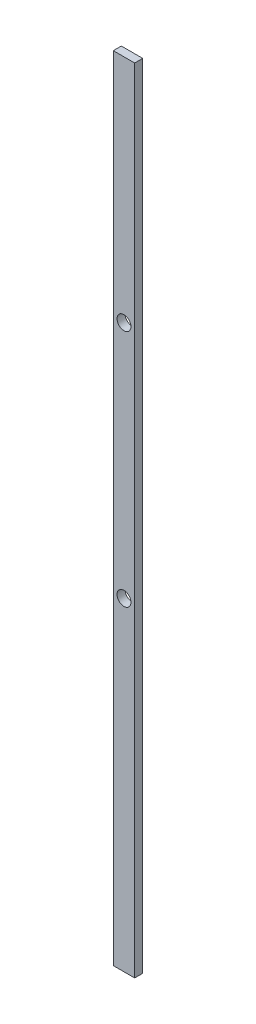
ISO-10303-21;
HEADER;
FILE_DESCRIPTION(('STEP AP214'),'2;1');
FILE_NAME('part.step','',(''),(''),'','','');
FILE_SCHEMA(('AUTOMOTIVE_DESIGN { 1 0 10303 214 1 1 1 1 }'));
ENDSEC;
DATA;
#1=APPLICATION_CONTEXT('core data for automotive mechanical design processes');
#2=APPLICATION_PROTOCOL_DEFINITION('international standard','automotive_design',2000,#1);
#3=PRODUCT_CONTEXT('',#1,'mechanical');
#4=PRODUCT('Part','Part','',(#3));
#5=PRODUCT_RELATED_PRODUCT_CATEGORY('part','',(#4));
#6=PRODUCT_DEFINITION_FORMATION('','',#4);
#7=PRODUCT_DEFINITION_CONTEXT('part definition',#1,'design');
#8=PRODUCT_DEFINITION('design','',#6,#7);
#9=PRODUCT_DEFINITION_SHAPE('','',#8);
#10=(LENGTH_UNIT() NAMED_UNIT(*) SI_UNIT(.MILLI.,.METRE.));
#11=(NAMED_UNIT(*) PLANE_ANGLE_UNIT() SI_UNIT($,.RADIAN.));
#12=(NAMED_UNIT(*) SI_UNIT($,.STERADIAN.) SOLID_ANGLE_UNIT());
#13=UNCERTAINTY_MEASURE_WITH_UNIT(LENGTH_MEASURE(1.E-05),#10,'distance_accuracy_value','');
#14=(GEOMETRIC_REPRESENTATION_CONTEXT(3) GLOBAL_UNCERTAINTY_ASSIGNED_CONTEXT((#13)) GLOBAL_UNIT_ASSIGNED_CONTEXT((#10,
#11,#12)) REPRESENTATION_CONTEXT('',''));
#15=CARTESIAN_POINT('',(0.,0.,0.));
#16=DIRECTION('',(0.,0.,1.));
#17=DIRECTION('',(1.,0.,0.));
#18=AXIS2_PLACEMENT_3D('',#15,#16,#17);
#19=CARTESIAN_POINT('',(0.,0.,7.5));
#20=DIRECTION('',(0.,0.,1.));
#21=DIRECTION('',(1.,0.,0.));
#22=AXIS2_PLACEMENT_3D('',#19,#20,#21);
#23=PLANE('',#22);
#24=CARTESIAN_POINT('',(0.,155.,7.5));
#25=DIRECTION('',(0.,0.,1.));
#26=DIRECTION('',(1.,0.,0.));
#27=AXIS2_PLACEMENT_3D('',#24,#25,#26);
#28=CIRCLE('',#27,6.5);
#29=CARTESIAN_POINT('',(6.5,155.,7.5));
#30=VERTEX_POINT('',#29);
#31=EDGE_CURVE('E25',#30,#30,#28,.T.);
#32=ORIENTED_EDGE('',*,*,#31,.F.);
#33=EDGE_LOOP('',(#32));
#34=FACE_BOUND('',#33,.T.);
#35=CARTESIAN_POINT('',(0.,-68.,7.5));
#36=DIRECTION('',(0.,0.,1.));
#37=DIRECTION('',(1.,0.,0.));
#38=AXIS2_PLACEMENT_3D('',#35,#36,#37);
#39=CIRCLE('',#38,6.5);
#40=CARTESIAN_POINT('',(6.5,-68.,7.5));
#41=VERTEX_POINT('',#40);
#42=EDGE_CURVE('E128',#41,#41,#39,.T.);
#43=ORIENTED_EDGE('',*,*,#42,.F.);
#44=EDGE_LOOP('',(#43));
#45=FACE_BOUND('',#44,.T.);
#46=DIRECTION('',(1.,0.,0.));
#47=VECTOR('',#46,1.);
#48=CARTESIAN_POINT('',(-10.,-370.,7.5));
#49=LINE('',#48,#47);
#50=CARTESIAN_POINT('',(-10.,-370.,7.5));
#51=VERTEX_POINT('',#50);
#52=CARTESIAN_POINT('',(10.,-370.,7.5));
#53=VERTEX_POINT('',#52);
#54=EDGE_CURVE('E118',#51,#53,#49,.T.);
#55=ORIENTED_EDGE('',*,*,#54,.T.);
#56=DIRECTION('',(0.,1.,0.));
#57=VECTOR('',#56,1.);
#58=CARTESIAN_POINT('',(10.,-370.,7.5));
#59=LINE('',#58,#57);
#60=CARTESIAN_POINT('',(10.,370.,7.5));
#61=VERTEX_POINT('',#60);
#62=EDGE_CURVE('E96',#53,#61,#59,.T.);
#63=ORIENTED_EDGE('',*,*,#62,.T.);
#64=DIRECTION('',(-1.,0.,0.));
#65=VECTOR('',#64,1.);
#66=CARTESIAN_POINT('',(10.,370.,7.5));
#67=LINE('',#66,#65);
#68=CARTESIAN_POINT('',(-10.,370.,7.5));
#69=VERTEX_POINT('',#68);
#70=EDGE_CURVE('E102',#61,#69,#67,.T.);
#71=ORIENTED_EDGE('',*,*,#70,.T.);
#72=DIRECTION('',(0.,-1.,0.));
#73=VECTOR('',#72,1.);
#74=CARTESIAN_POINT('',(-10.,370.,7.5));
#75=LINE('',#74,#73);
#76=EDGE_CURVE('E122',#69,#51,#75,.T.);
#77=ORIENTED_EDGE('',*,*,#76,.T.);
#78=EDGE_LOOP('',(#55,#63,#71,#77));
#79=FACE_BOUND('',#78,.T.);
#80=ADVANCED_FACE('F16',(#34,#45,#79),#23,.T.);
#81=CARTESIAN_POINT('',(0.,0.,0.));
#82=DIRECTION('',(0.,0.,1.));
#83=DIRECTION('',(1.,0.,0.));
#84=AXIS2_PLACEMENT_3D('',#81,#82,#83);
#85=PLANE('',#84);
#86=CARTESIAN_POINT('',(0.,155.,0.));
#87=DIRECTION('',(0.,0.,1.));
#88=DIRECTION('',(1.,0.,0.));
#89=AXIS2_PLACEMENT_3D('',#86,#87,#88);
#90=CIRCLE('',#89,6.5);
#91=CARTESIAN_POINT('',(6.5,155.,0.));
#92=VERTEX_POINT('',#91);
#93=EDGE_CURVE('E10',#92,#92,#90,.T.);
#94=ORIENTED_EDGE('',*,*,#93,.T.);
#95=EDGE_LOOP('',(#94));
#96=FACE_BOUND('',#95,.T.);
#97=CARTESIAN_POINT('',(0.,-68.,0.));
#98=DIRECTION('',(0.,0.,1.));
#99=DIRECTION('',(1.,0.,0.));
#100=AXIS2_PLACEMENT_3D('',#97,#98,#99);
#101=CIRCLE('',#100,6.5);
#102=CARTESIAN_POINT('',(6.5,-68.,0.));
#103=VERTEX_POINT('',#102);
#104=EDGE_CURVE('E131',#103,#103,#101,.T.);
#105=ORIENTED_EDGE('',*,*,#104,.T.);
#106=EDGE_LOOP('',(#105));
#107=FACE_BOUND('',#106,.T.);
#108=DIRECTION('',(0.,-1.,0.));
#109=VECTOR('',#108,1.);
#110=CARTESIAN_POINT('',(-10.,370.,0.));
#111=LINE('',#110,#109);
#112=CARTESIAN_POINT('',(-10.,370.,0.));
#113=VERTEX_POINT('',#112);
#114=CARTESIAN_POINT('',(-10.,-370.,0.));
#115=VERTEX_POINT('',#114);
#116=EDGE_CURVE('E90',#113,#115,#111,.T.);
#117=ORIENTED_EDGE('',*,*,#116,.F.);
#118=DIRECTION('',(-1.,0.,0.));
#119=VECTOR('',#118,1.);
#120=CARTESIAN_POINT('',(10.,370.,0.));
#121=LINE('',#120,#119);
#122=CARTESIAN_POINT('',(10.,370.,0.));
#123=VERTEX_POINT('',#122);
#124=EDGE_CURVE('E84',#123,#113,#121,.T.);
#125=ORIENTED_EDGE('',*,*,#124,.F.);
#126=DIRECTION('',(0.,1.,0.));
#127=VECTOR('',#126,1.);
#128=CARTESIAN_POINT('',(10.,-370.,0.));
#129=LINE('',#128,#127);
#130=CARTESIAN_POINT('',(10.,-370.,0.));
#131=VERTEX_POINT('',#130);
#132=EDGE_CURVE('E88',#131,#123,#129,.T.);
#133=ORIENTED_EDGE('',*,*,#132,.F.);
#134=DIRECTION('',(1.,0.,0.));
#135=VECTOR('',#134,1.);
#136=CARTESIAN_POINT('',(-10.,-370.,0.));
#137=LINE('',#136,#135);
#138=EDGE_CURVE('E233',#115,#131,#137,.T.);
#139=ORIENTED_EDGE('',*,*,#138,.F.);
#140=EDGE_LOOP('',(#117,#125,#133,#139));
#141=FACE_BOUND('',#140,.T.);
#142=ADVANCED_FACE('F18',(#96,#107,#141),#85,.F.);
#143=CARTESIAN_POINT('',(0.,155.,0.));
#144=DIRECTION('',(0.,0.,-1.));
#145=DIRECTION('',(1.,0.,0.));
#146=AXIS2_PLACEMENT_3D('',#143,#144,#145);
#147=CYLINDRICAL_SURFACE('',#146,6.5);
#148=DIRECTION('',(0.,0.,1.));
#149=VECTOR('',#148,1.);
#150=CARTESIAN_POINT('',(6.5,155.,0.));
#151=LINE('',#150,#149);
#152=EDGE_CURVE('E136',#92,#30,#151,.T.);
#153=ORIENTED_EDGE('',*,*,#152,.T.);
#154=ORIENTED_EDGE('',*,*,#31,.T.);
#155=ORIENTED_EDGE('',*,*,#152,.F.);
#156=ORIENTED_EDGE('',*,*,#93,.F.);
#157=EDGE_LOOP('',(#153,#154,#155,#156));
#158=FACE_BOUND('',#157,.T.);
#159=ADVANCED_FACE('F151',(#158),#147,.F.);
#160=CARTESIAN_POINT('',(0.,-68.,0.));
#161=DIRECTION('',(0.,0.,-1.));
#162=DIRECTION('',(1.,0.,0.));
#163=AXIS2_PLACEMENT_3D('',#160,#161,#162);
#164=CYLINDRICAL_SURFACE('',#163,6.5);
#165=DIRECTION('',(0.,0.,1.));
#166=VECTOR('',#165,1.);
#167=CARTESIAN_POINT('',(6.5,-68.,0.));
#168=LINE('',#167,#166);
#169=EDGE_CURVE('E124',#103,#41,#168,.T.);
#170=ORIENTED_EDGE('',*,*,#169,.T.);
#171=ORIENTED_EDGE('',*,*,#42,.T.);
#172=ORIENTED_EDGE('',*,*,#169,.F.);
#173=ORIENTED_EDGE('',*,*,#104,.F.);
#174=EDGE_LOOP('',(#170,#171,#172,#173));
#175=FACE_BOUND('',#174,.T.);
#176=ADVANCED_FACE('F145',(#175),#164,.F.);
#177=CARTESIAN_POINT('',(-10.,370.,0.));
#178=DIRECTION('',(1.,0.,0.));
#179=DIRECTION('',(0.,1.,0.));
#180=AXIS2_PLACEMENT_3D('',#177,#178,#179);
#181=PLANE('',#180);
#182=ORIENTED_EDGE('',*,*,#116,.T.);
#183=DIRECTION('',(0.,0.,1.));
#184=VECTOR('',#183,1.);
#185=CARTESIAN_POINT('',(-10.,-370.,0.));
#186=LINE('',#185,#184);
#187=EDGE_CURVE('E112',#115,#51,#186,.T.);
#188=ORIENTED_EDGE('',*,*,#187,.T.);
#189=ORIENTED_EDGE('',*,*,#76,.F.);
#190=DIRECTION('',(0.,0.,1.));
#191=VECTOR('',#190,1.);
#192=CARTESIAN_POINT('',(-10.,370.,0.));
#193=LINE('',#192,#191);
#194=EDGE_CURVE('E95',#113,#69,#193,.T.);
#195=ORIENTED_EDGE('',*,*,#194,.F.);
#196=EDGE_LOOP('',(#182,#188,#189,#195));
#197=FACE_BOUND('',#196,.T.);
#198=ADVANCED_FACE('F150',(#197),#181,.F.);
#199=CARTESIAN_POINT('',(10.,370.,0.));
#200=DIRECTION('',(0.,-1.,0.));
#201=DIRECTION('',(0.,0.,-1.));
#202=AXIS2_PLACEMENT_3D('',#199,#200,#201);
#203=PLANE('',#202);
#204=ORIENTED_EDGE('',*,*,#124,.T.);
#205=ORIENTED_EDGE('',*,*,#194,.T.);
#206=ORIENTED_EDGE('',*,*,#70,.F.);
#207=DIRECTION('',(0.,0.,1.));
#208=VECTOR('',#207,1.);
#209=CARTESIAN_POINT('',(10.,370.,0.));
#210=LINE('',#209,#208);
#211=EDGE_CURVE('E99',#123,#61,#210,.T.);
#212=ORIENTED_EDGE('',*,*,#211,.F.);
#213=EDGE_LOOP('',(#204,#205,#206,#212));
#214=FACE_BOUND('',#213,.T.);
#215=ADVANCED_FACE('F100',(#214),#203,.F.);
#216=CARTESIAN_POINT('',(10.,-370.,0.));
#217=DIRECTION('',(-1.,0.,0.));
#218=DIRECTION('',(0.,0.,1.));
#219=AXIS2_PLACEMENT_3D('',#216,#217,#218);
#220=PLANE('',#219);
#221=ORIENTED_EDGE('',*,*,#132,.T.);
#222=ORIENTED_EDGE('',*,*,#211,.T.);
#223=ORIENTED_EDGE('',*,*,#62,.F.);
#224=DIRECTION('',(0.,0.,1.));
#225=VECTOR('',#224,1.);
#226=CARTESIAN_POINT('',(10.,-370.,0.));
#227=LINE('',#226,#225);
#228=EDGE_CURVE('E109',#131,#53,#227,.T.);
#229=ORIENTED_EDGE('',*,*,#228,.F.);
#230=EDGE_LOOP('',(#221,#222,#223,#229));
#231=FACE_BOUND('',#230,.T.);
#232=ADVANCED_FACE('F107',(#231),#220,.F.);
#233=CARTESIAN_POINT('',(-10.,-370.,0.));
#234=DIRECTION('',(0.,1.,0.));
#235=DIRECTION('',(1.,0.,0.));
#236=AXIS2_PLACEMENT_3D('',#233,#234,#235);
#237=PLANE('',#236);
#238=ORIENTED_EDGE('',*,*,#138,.T.);
#239=ORIENTED_EDGE('',*,*,#228,.T.);
#240=ORIENTED_EDGE('',*,*,#54,.F.);
#241=ORIENTED_EDGE('',*,*,#187,.F.);
#242=EDGE_LOOP('',(#238,#239,#240,#241));
#243=FACE_BOUND('',#242,.T.);
#244=ADVANCED_FACE('F159',(#243),#237,.F.);
#245=CLOSED_SHELL('',(#80,#142,#159,#176,#198,#215,#232,#244));
#246=MANIFOLD_SOLID_BREP('B1',#245);
#247=ADVANCED_BREP_SHAPE_REPRESENTATION('',(#18,#246),#14);
#248=SHAPE_DEFINITION_REPRESENTATION(#9,#247);
ENDSEC;
END-ISO-10303-21;
